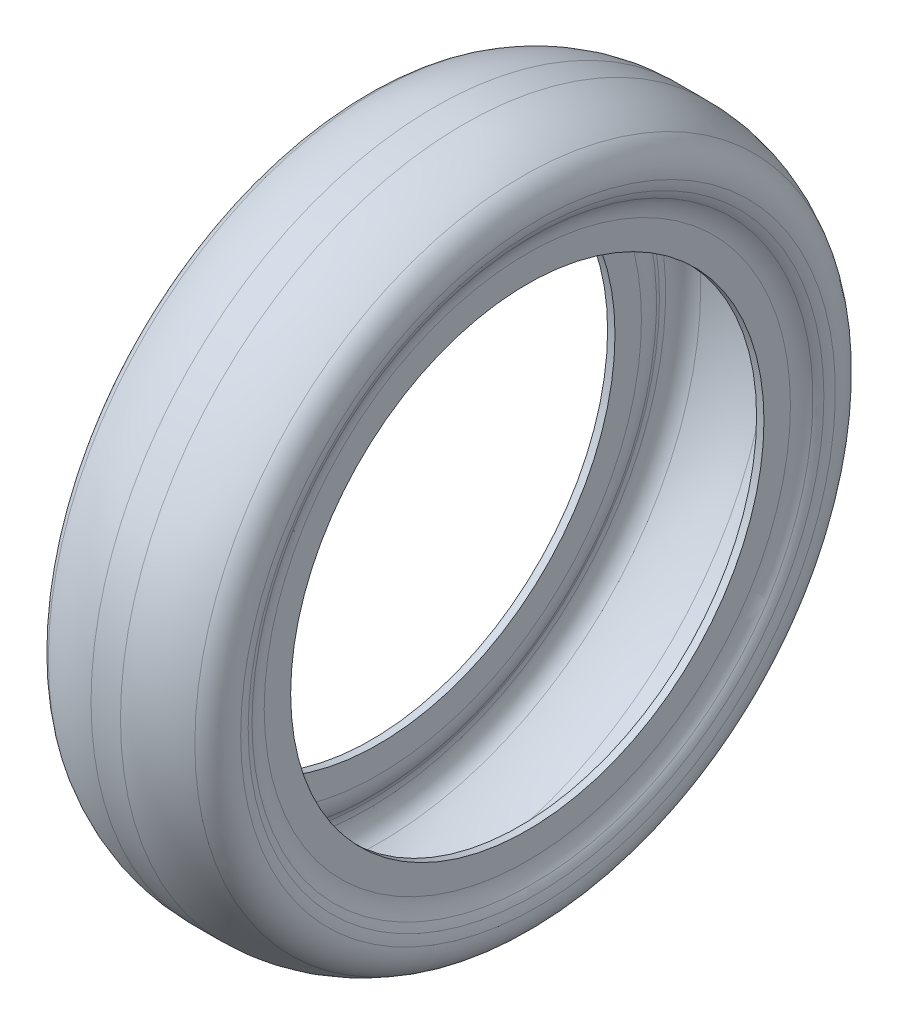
ISO-10303-21;
HEADER;
FILE_DESCRIPTION(('STEP AP214'),'2;1');
FILE_NAME('part.step','',(''),(''),'','','');
FILE_SCHEMA(('AUTOMOTIVE_DESIGN { 1 0 10303 214 1 1 1 1 }'));
ENDSEC;
DATA;
#1=APPLICATION_CONTEXT('core data for automotive mechanical design processes');
#2=APPLICATION_PROTOCOL_DEFINITION('international standard','automotive_design',2000,#1);
#3=PRODUCT_CONTEXT('',#1,'mechanical');
#4=PRODUCT('Part','Part','',(#3));
#5=PRODUCT_RELATED_PRODUCT_CATEGORY('part','',(#4));
#6=PRODUCT_DEFINITION_FORMATION('','',#4);
#7=PRODUCT_DEFINITION_CONTEXT('part definition',#1,'design');
#8=PRODUCT_DEFINITION('design','',#6,#7);
#9=PRODUCT_DEFINITION_SHAPE('','',#8);
#10=(LENGTH_UNIT() NAMED_UNIT(*) SI_UNIT(.MILLI.,.METRE.));
#11=(NAMED_UNIT(*) PLANE_ANGLE_UNIT() SI_UNIT($,.RADIAN.));
#12=(NAMED_UNIT(*) SI_UNIT($,.STERADIAN.) SOLID_ANGLE_UNIT());
#13=UNCERTAINTY_MEASURE_WITH_UNIT(LENGTH_MEASURE(1.E-05),#10,'distance_accuracy_value','');
#14=(GEOMETRIC_REPRESENTATION_CONTEXT(3) GLOBAL_UNCERTAINTY_ASSIGNED_CONTEXT((#13)) GLOBAL_UNIT_ASSIGNED_CONTEXT((#10,
#11,#12)) REPRESENTATION_CONTEXT('',''));
#15=CARTESIAN_POINT('',(0.,0.,0.));
#16=DIRECTION('',(0.,0.,1.));
#17=DIRECTION('',(1.,0.,0.));
#18=AXIS2_PLACEMENT_3D('',#15,#16,#17);
#19=CARTESIAN_POINT('',(-74.,224.,0.));
#20=DIRECTION('',(1.,0.,0.));
#21=DIRECTION('',(0.,0.,-1.));
#22=AXIS2_PLACEMENT_3D('',#19,#20,#21);
#23=PLANE('',#22);
#24=CARTESIAN_POINT('',(-74.,0.,0.));
#25=DIRECTION('',(-1.,0.,0.));
#26=DIRECTION('',(0.,0.,1.));
#27=AXIS2_PLACEMENT_3D('',#24,#25,#26);
#28=CIRCLE('',#27,224.);
#29=CARTESIAN_POINT('',(-74.,0.,224.));
#30=VERTEX_POINT('',#29);
#31=EDGE_CURVE('E10',#30,#30,#28,.T.);
#32=ORIENTED_EDGE('',*,*,#31,.F.);
#33=EDGE_LOOP('',(#32));
#34=FACE_BOUND('',#33,.T.);
#35=CARTESIAN_POINT('',(-74.,0.,0.));
#36=DIRECTION('',(-1.,0.,0.));
#37=DIRECTION('',(0.,0.,1.));
#38=AXIS2_PLACEMENT_3D('',#35,#36,#37);
#39=CIRCLE('',#38,249.04926879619);
#40=CARTESIAN_POINT('',(-74.,0.,249.04926879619));
#41=VERTEX_POINT('',#40);
#42=EDGE_CURVE('E120',#41,#41,#39,.T.);
#43=ORIENTED_EDGE('',*,*,#42,.T.);
#44=EDGE_LOOP('',(#43));
#45=FACE_BOUND('',#44,.T.);
#46=ADVANCED_FACE('F32',(#34,#45),#23,.F.);
#47=CARTESIAN_POINT('',(130.136206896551,0.,0.));
#48=DIRECTION('',(-1.,0.,0.));
#49=DIRECTION('',(0.,0.,1.));
#50=AXIS2_PLACEMENT_3D('',#47,#48,#49);
#51=CYLINDRICAL_SURFACE('',#50,224.);
#52=ORIENTED_EDGE('',*,*,#31,.T.);
#53=EDGE_LOOP('',(#52));
#54=FACE_BOUND('',#53,.T.);
#55=CARTESIAN_POINT('',(-67.,0.,0.));
#56=DIRECTION('',(-1.,0.,0.));
#57=DIRECTION('',(0.,0.,1.));
#58=AXIS2_PLACEMENT_3D('',#55,#56,#57);
#59=CIRCLE('',#58,224.);
#60=CARTESIAN_POINT('',(-67.,0.,224.));
#61=VERTEX_POINT('',#60);
#62=EDGE_CURVE('E38',#61,#61,#59,.T.);
#63=ORIENTED_EDGE('',*,*,#62,.F.);
#64=EDGE_LOOP('',(#63));
#65=FACE_BOUND('',#64,.T.);
#66=ADVANCED_FACE('F209',(#54,#65),#51,.F.);
#67=CARTESIAN_POINT('',(-67.,224.,0.));
#68=DIRECTION('',(1.,0.,0.));
#69=DIRECTION('',(0.,0.,-1.));
#70=AXIS2_PLACEMENT_3D('',#67,#68,#69);
#71=PLANE('',#70);
#72=ORIENTED_EDGE('',*,*,#62,.T.);
#73=EDGE_LOOP('',(#72));
#74=FACE_BOUND('',#73,.T.);
#75=CARTESIAN_POINT('',(-67.,0.,0.));
#76=DIRECTION('',(-1.,0.,0.));
#77=DIRECTION('',(0.,0.,1.));
#78=AXIS2_PLACEMENT_3D('',#75,#76,#77);
#79=CIRCLE('',#78,249.04926879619);
#80=CARTESIAN_POINT('',(-67.,0.,249.04926879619));
#81=VERTEX_POINT('',#80);
#82=EDGE_CURVE('E42',#81,#81,#79,.T.);
#83=ORIENTED_EDGE('',*,*,#82,.F.);
#84=EDGE_LOOP('',(#83));
#85=FACE_BOUND('',#84,.T.);
#86=ADVANCED_FACE('F214',(#74,#85),#71,.T.);
#87=CARTESIAN_POINT('',(-104.,0.,0.));
#88=DIRECTION('',(-1.,0.,0.));
#89=DIRECTION('',(0.,0.,1.));
#90=AXIS2_PLACEMENT_3D('',#87,#88,#89);
#91=TOROIDAL_SURFACE('',#90,249.04926879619,37.);
#92=ORIENTED_EDGE('',*,*,#82,.T.);
#93=EDGE_LOOP('',(#92));
#94=FACE_BOUND('',#93,.T.);
#95=CARTESIAN_POINT('',(-73.0245367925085,0.,0.));
#96=DIRECTION('',(-1.,0.,0.));
#97=DIRECTION('',(0.,0.,1.));
#98=AXIS2_PLACEMENT_3D('',#95,#96,#97);
#99=CIRCLE('',#98,269.285886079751);
#100=CARTESIAN_POINT('',(-73.0245367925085,0.,269.285886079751));
#101=VERTEX_POINT('',#100);
#102=EDGE_CURVE('E46',#101,#101,#99,.T.);
#103=ORIENTED_EDGE('',*,*,#102,.F.);
#104=EDGE_LOOP('',(#103));
#105=FACE_BOUND('',#104,.T.);
#106=ADVANCED_FACE('F218',(#94,#105),#91,.T.);
#107=CARTESIAN_POINT('',(-53.7695191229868,0.,0.));
#108=DIRECTION('',(-1.,0.,0.));
#109=DIRECTION('',(0.,0.,1.));
#110=AXIS2_PLACEMENT_3D('',#107,#108,#109);
#111=TOROIDAL_SURFACE('',#110,281.865404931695,23.);
#112=ORIENTED_EDGE('',*,*,#102,.T.);
#113=EDGE_LOOP('',(#112));
#114=FACE_BOUND('',#113,.T.);
#115=CARTESIAN_POINT('',(-75.6103551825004,0.,0.));
#116=DIRECTION('',(-1.,0.,0.));
#117=DIRECTION('',(0.,0.,1.));
#118=AXIS2_PLACEMENT_3D('',#115,#116,#117);
#119=CIRCLE('',#118,274.655836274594);
#120=CARTESIAN_POINT('',(-75.6103551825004,0.,274.655836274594));
#121=VERTEX_POINT('',#120);
#122=EDGE_CURVE('E51',#121,#121,#119,.T.);
#123=ORIENTED_EDGE('',*,*,#122,.F.);
#124=EDGE_LOOP('',(#123));
#125=FACE_BOUND('',#124,.T.);
#126=ADVANCED_FACE('F224',(#114,#125),#111,.F.);
#127=CARTESIAN_POINT('',(-44.2735034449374,0.,0.));
#128=DIRECTION('',(-1.,0.,0.));
#129=DIRECTION('',(0.,0.,1.));
#130=AXIS2_PLACEMENT_3D('',#127,#128,#129);
#131=TOROIDAL_SURFACE('',#130,285.,33.);
#132=ORIENTED_EDGE('',*,*,#122,.T.);
#133=EDGE_LOOP('',(#132));
#134=FACE_BOUND('',#133,.T.);
#135=CARTESIAN_POINT('',(-77.1417079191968,0.,0.));
#136=DIRECTION('',(-1.,0.,0.));
#137=DIRECTION('',(0.,0.,1.));
#138=AXIS2_PLACEMENT_3D('',#135,#136,#137);
#139=CIRCLE('',#138,282.053623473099);
#140=CARTESIAN_POINT('',(-77.1417079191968,0.,282.053623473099));
#141=VERTEX_POINT('',#140);
#142=EDGE_CURVE('E54',#141,#141,#139,.T.);
#143=ORIENTED_EDGE('',*,*,#142,.F.);
#144=EDGE_LOOP('',(#143));
#145=FACE_BOUND('',#144,.T.);
#146=ADVANCED_FACE('F228',(#134,#145),#131,.F.);
#147=CARTESIAN_POINT('',(-54.2335654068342,0.,0.));
#148=DIRECTION('',(-1.,0.,0.));
#149=DIRECTION('',(0.,0.,1.));
#150=AXIS2_PLACEMENT_3D('',#147,#148,#149);
#151=TOROIDAL_SURFACE('',#150,284.107158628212,23.);
#152=ORIENTED_EDGE('',*,*,#142,.T.);
#153=EDGE_LOOP('',(#152));
#154=FACE_BOUND('',#153,.T.);
#155=CARTESIAN_POINT('',(-65.8202100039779,0.,0.));
#156=DIRECTION('',(-1.,0.,0.));
#157=DIRECTION('',(0.,0.,1.));
#158=AXIS2_PLACEMENT_3D('',#155,#156,#157);
#159=CIRCLE('',#158,303.975466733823);
#160=CARTESIAN_POINT('',(-65.8202100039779,0.,303.975466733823));
#161=VERTEX_POINT('',#160);
#162=EDGE_CURVE('E57',#161,#161,#159,.T.);
#163=ORIENTED_EDGE('',*,*,#162,.F.);
#164=EDGE_LOOP('',(#163));
#165=FACE_BOUND('',#164,.T.);
#166=ADVANCED_FACE('F232',(#154,#165),#151,.F.);
#167=CARTESIAN_POINT('',(-13.9321928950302,0.,0.));
#168=DIRECTION('',(-1.,0.,0.));
#169=DIRECTION('',(0.,0.,1.));
#170=AXIS2_PLACEMENT_3D('',#167,#168,#169);
#171=TOROIDAL_SURFACE('',#170,215.,103.);
#172=ORIENTED_EDGE('',*,*,#162,.T.);
#173=EDGE_LOOP('',(#172));
#174=FACE_BOUND('',#173,.T.);
#175=CARTESIAN_POINT('',(-13.9321928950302,0.,0.));
#176=DIRECTION('',(-1.,0.,0.));
#177=DIRECTION('',(0.,0.,1.));
#178=AXIS2_PLACEMENT_3D('',#175,#176,#177);
#179=CIRCLE('',#178,318.);
#180=CARTESIAN_POINT('',(-13.9321928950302,0.,318.));
#181=VERTEX_POINT('',#180);
#182=EDGE_CURVE('E60',#181,#181,#179,.T.);
#183=ORIENTED_EDGE('',*,*,#182,.F.);
#184=EDGE_LOOP('',(#183));
#185=FACE_BOUND('',#184,.T.);
#186=ADVANCED_FACE('F236',(#174,#185),#171,.F.);
#187=CARTESIAN_POINT('',(130.136206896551,0.,0.));
#188=DIRECTION('',(-1.,0.,0.));
#189=DIRECTION('',(0.,0.,1.));
#190=AXIS2_PLACEMENT_3D('',#187,#188,#189);
#191=CYLINDRICAL_SURFACE('',#190,318.);
#192=ORIENTED_EDGE('',*,*,#182,.T.);
#193=EDGE_LOOP('',(#192));
#194=FACE_BOUND('',#193,.T.);
#195=CARTESIAN_POINT('',(13.9321928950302,0.,0.));
#196=DIRECTION('',(-1.,0.,0.));
#197=DIRECTION('',(0.,0.,1.));
#198=AXIS2_PLACEMENT_3D('',#195,#196,#197);
#199=CIRCLE('',#198,318.);
#200=CARTESIAN_POINT('',(13.9321928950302,0.,318.));
#201=VERTEX_POINT('',#200);
#202=EDGE_CURVE('E63',#201,#201,#199,.T.);
#203=ORIENTED_EDGE('',*,*,#202,.F.);
#204=EDGE_LOOP('',(#203));
#205=FACE_BOUND('',#204,.T.);
#206=ADVANCED_FACE('F240',(#194,#205),#191,.F.);
#207=CARTESIAN_POINT('',(13.9321928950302,0.,0.));
#208=DIRECTION('',(-1.,0.,0.));
#209=DIRECTION('',(0.,0.,1.));
#210=AXIS2_PLACEMENT_3D('',#207,#208,#209);
#211=TOROIDAL_SURFACE('',#210,215.,103.);
#212=ORIENTED_EDGE('',*,*,#202,.T.);
#213=EDGE_LOOP('',(#212));
#214=FACE_BOUND('',#213,.T.);
#215=CARTESIAN_POINT('',(65.8202100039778,0.,0.));
#216=DIRECTION('',(-1.,0.,0.));
#217=DIRECTION('',(0.,0.,1.));
#218=AXIS2_PLACEMENT_3D('',#215,#216,#217);
#219=CIRCLE('',#218,303.975466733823);
#220=CARTESIAN_POINT('',(65.8202100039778,0.,303.975466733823));
#221=VERTEX_POINT('',#220);
#222=EDGE_CURVE('E66',#221,#221,#219,.T.);
#223=ORIENTED_EDGE('',*,*,#222,.F.);
#224=EDGE_LOOP('',(#223));
#225=FACE_BOUND('',#224,.T.);
#226=ADVANCED_FACE('F244',(#214,#225),#211,.F.);
#227=CARTESIAN_POINT('',(54.2335654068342,0.,0.));
#228=DIRECTION('',(-1.,0.,0.));
#229=DIRECTION('',(0.,0.,1.));
#230=AXIS2_PLACEMENT_3D('',#227,#228,#229);
#231=TOROIDAL_SURFACE('',#230,284.107158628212,23.);
#232=ORIENTED_EDGE('',*,*,#222,.T.);
#233=EDGE_LOOP('',(#232));
#234=FACE_BOUND('',#233,.T.);
#235=CARTESIAN_POINT('',(77.1417079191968,0.,0.));
#236=DIRECTION('',(-1.,0.,0.));
#237=DIRECTION('',(0.,0.,1.));
#238=AXIS2_PLACEMENT_3D('',#235,#236,#237);
#239=CIRCLE('',#238,282.053623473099);
#240=CARTESIAN_POINT('',(77.1417079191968,0.,282.053623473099));
#241=VERTEX_POINT('',#240);
#242=EDGE_CURVE('E69',#241,#241,#239,.T.);
#243=ORIENTED_EDGE('',*,*,#242,.F.);
#244=EDGE_LOOP('',(#243));
#245=FACE_BOUND('',#244,.T.);
#246=ADVANCED_FACE('F248',(#234,#245),#231,.F.);
#247=CARTESIAN_POINT('',(44.2735034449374,0.,0.));
#248=DIRECTION('',(-1.,0.,0.));
#249=DIRECTION('',(0.,0.,1.));
#250=AXIS2_PLACEMENT_3D('',#247,#248,#249);
#251=TOROIDAL_SURFACE('',#250,285.,33.);
#252=ORIENTED_EDGE('',*,*,#242,.T.);
#253=EDGE_LOOP('',(#252));
#254=FACE_BOUND('',#253,.T.);
#255=CARTESIAN_POINT('',(75.6103551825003,0.,0.));
#256=DIRECTION('',(-1.,0.,0.));
#257=DIRECTION('',(0.,0.,1.));
#258=AXIS2_PLACEMENT_3D('',#255,#256,#257);
#259=CIRCLE('',#258,274.655836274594);
#260=CARTESIAN_POINT('',(75.6103551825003,0.,274.655836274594));
#261=VERTEX_POINT('',#260);
#262=EDGE_CURVE('E72',#261,#261,#259,.T.);
#263=ORIENTED_EDGE('',*,*,#262,.F.);
#264=EDGE_LOOP('',(#263));
#265=FACE_BOUND('',#264,.T.);
#266=ADVANCED_FACE('F252',(#254,#265),#251,.F.);
#267=CARTESIAN_POINT('',(53.7695191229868,0.,0.));
#268=DIRECTION('',(-1.,0.,0.));
#269=DIRECTION('',(0.,0.,1.));
#270=AXIS2_PLACEMENT_3D('',#267,#268,#269);
#271=TOROIDAL_SURFACE('',#270,281.865404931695,23.);
#272=ORIENTED_EDGE('',*,*,#262,.T.);
#273=EDGE_LOOP('',(#272));
#274=FACE_BOUND('',#273,.T.);
#275=CARTESIAN_POINT('',(73.0245367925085,0.,0.));
#276=DIRECTION('',(-1.,0.,0.));
#277=DIRECTION('',(0.,0.,1.));
#278=AXIS2_PLACEMENT_3D('',#275,#276,#277);
#279=CIRCLE('',#278,269.285886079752);
#280=CARTESIAN_POINT('',(73.0245367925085,0.,269.285886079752));
#281=VERTEX_POINT('',#280);
#282=EDGE_CURVE('E75',#281,#281,#279,.T.);
#283=ORIENTED_EDGE('',*,*,#282,.F.);
#284=EDGE_LOOP('',(#283));
#285=FACE_BOUND('',#284,.T.);
#286=ADVANCED_FACE('F256',(#274,#285),#271,.F.);
#287=CARTESIAN_POINT('',(104.,0.,0.));
#288=DIRECTION('',(-1.,0.,0.));
#289=DIRECTION('',(0.,0.,1.));
#290=AXIS2_PLACEMENT_3D('',#287,#288,#289);
#291=TOROIDAL_SURFACE('',#290,249.04926879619,37.);
#292=ORIENTED_EDGE('',*,*,#282,.T.);
#293=EDGE_LOOP('',(#292));
#294=FACE_BOUND('',#293,.T.);
#295=CARTESIAN_POINT('',(67.,0.,0.));
#296=DIRECTION('',(-1.,0.,0.));
#297=DIRECTION('',(0.,0.,1.));
#298=AXIS2_PLACEMENT_3D('',#295,#296,#297);
#299=CIRCLE('',#298,249.04926879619);
#300=CARTESIAN_POINT('',(67.,0.,249.04926879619));
#301=VERTEX_POINT('',#300);
#302=EDGE_CURVE('E78',#301,#301,#299,.T.);
#303=ORIENTED_EDGE('',*,*,#302,.F.);
#304=EDGE_LOOP('',(#303));
#305=FACE_BOUND('',#304,.T.);
#306=ADVANCED_FACE('F205',(#294,#305),#291,.T.);
#307=CARTESIAN_POINT('',(67.,224.,0.));
#308=DIRECTION('',(-1.,0.,0.));
#309=DIRECTION('',(0.,0.,1.));
#310=AXIS2_PLACEMENT_3D('',#307,#308,#309);
#311=PLANE('',#310);
#312=ORIENTED_EDGE('',*,*,#302,.T.);
#313=EDGE_LOOP('',(#312));
#314=FACE_BOUND('',#313,.T.);
#315=CARTESIAN_POINT('',(67.,0.,0.));
#316=DIRECTION('',(-1.,0.,0.));
#317=DIRECTION('',(0.,0.,1.));
#318=AXIS2_PLACEMENT_3D('',#315,#316,#317);
#319=CIRCLE('',#318,224.);
#320=CARTESIAN_POINT('',(67.,0.,224.));
#321=VERTEX_POINT('',#320);
#322=EDGE_CURVE('E81',#321,#321,#319,.T.);
#323=ORIENTED_EDGE('',*,*,#322,.F.);
#324=EDGE_LOOP('',(#323));
#325=FACE_BOUND('',#324,.T.);
#326=ADVANCED_FACE('F199',(#314,#325),#311,.T.);
#327=CARTESIAN_POINT('',(130.136206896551,0.,0.));
#328=DIRECTION('',(-1.,0.,0.));
#329=DIRECTION('',(0.,0.,1.));
#330=AXIS2_PLACEMENT_3D('',#327,#328,#329);
#331=CYLINDRICAL_SURFACE('',#330,224.);
#332=ORIENTED_EDGE('',*,*,#322,.T.);
#333=EDGE_LOOP('',(#332));
#334=FACE_BOUND('',#333,.T.);
#335=CARTESIAN_POINT('',(74.,0.,0.));
#336=DIRECTION('',(-1.,0.,0.));
#337=DIRECTION('',(0.,0.,1.));
#338=AXIS2_PLACEMENT_3D('',#335,#336,#337);
#339=CIRCLE('',#338,224.);
#340=CARTESIAN_POINT('',(74.,0.,224.));
#341=VERTEX_POINT('',#340);
#342=EDGE_CURVE('E84',#341,#341,#339,.T.);
#343=ORIENTED_EDGE('',*,*,#342,.F.);
#344=EDGE_LOOP('',(#343));
#345=FACE_BOUND('',#344,.T.);
#346=ADVANCED_FACE('F194',(#334,#345),#331,.F.);
#347=CARTESIAN_POINT('',(74.,224.,0.));
#348=DIRECTION('',(-1.,0.,0.));
#349=DIRECTION('',(0.,0.,1.));
#350=AXIS2_PLACEMENT_3D('',#347,#348,#349);
#351=PLANE('',#350);
#352=CARTESIAN_POINT('',(74.,0.,0.));
#353=DIRECTION('',(-1.,0.,0.));
#354=DIRECTION('',(0.,0.,1.));
#355=AXIS2_PLACEMENT_3D('',#352,#353,#354);
#356=CIRCLE('',#355,249.04926879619);
#357=CARTESIAN_POINT('',(74.,0.,249.04926879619));
#358=VERTEX_POINT('',#357);
#359=EDGE_CURVE('E87',#358,#358,#356,.T.);
#360=ORIENTED_EDGE('',*,*,#359,.F.);
#361=EDGE_LOOP('',(#360));
#362=FACE_BOUND('',#361,.T.);
#363=ORIENTED_EDGE('',*,*,#342,.T.);
#364=EDGE_LOOP('',(#363));
#365=FACE_BOUND('',#364,.T.);
#366=ADVANCED_FACE('F188',(#362,#365),#351,.F.);
#367=CARTESIAN_POINT('',(104.,0.,0.));
#368=DIRECTION('',(-1.,0.,0.));
#369=DIRECTION('',(0.,0.,1.));
#370=AXIS2_PLACEMENT_3D('',#367,#368,#369);
#371=TOROIDAL_SURFACE('',#370,249.04926879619,30.);
#372=CARTESIAN_POINT('',(78.8847595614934,0.,0.));
#373=DIRECTION('',(-1.,0.,0.));
#374=DIRECTION('',(0.,0.,1.));
#375=AXIS2_PLACEMENT_3D('',#372,#373,#374);
#376=CIRCLE('',#375,265.457336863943);
#377=CARTESIAN_POINT('',(78.8847595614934,0.,265.457336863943));
#378=VERTEX_POINT('',#377);
#379=EDGE_CURVE('E90',#378,#378,#376,.T.);
#380=ORIENTED_EDGE('',*,*,#379,.F.);
#381=EDGE_LOOP('',(#380));
#382=FACE_BOUND('',#381,.T.);
#383=ORIENTED_EDGE('',*,*,#359,.T.);
#384=EDGE_LOOP('',(#383));
#385=FACE_BOUND('',#384,.T.);
#386=ADVANCED_FACE('F182',(#382,#385),#371,.F.);
#387=CARTESIAN_POINT('',(53.7695191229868,0.,0.));
#388=DIRECTION('',(-1.,0.,0.));
#389=DIRECTION('',(0.,0.,1.));
#390=AXIS2_PLACEMENT_3D('',#387,#388,#389);
#391=TOROIDAL_SURFACE('',#390,281.865404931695,30.);
#392=CARTESIAN_POINT('',(82.2575661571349,0.,0.));
#393=DIRECTION('',(-1.,0.,0.));
#394=DIRECTION('',(0.,0.,1.));
#395=AXIS2_PLACEMENT_3D('',#392,#393,#394);
#396=CIRCLE('',#395,272.461619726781);
#397=CARTESIAN_POINT('',(82.2575661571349,0.,272.461619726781));
#398=VERTEX_POINT('',#397);
#399=EDGE_CURVE('E93',#398,#398,#396,.T.);
#400=ORIENTED_EDGE('',*,*,#399,.F.);
#401=EDGE_LOOP('',(#400));
#402=FACE_BOUND('',#401,.T.);
#403=ORIENTED_EDGE('',*,*,#379,.T.);
#404=EDGE_LOOP('',(#403));
#405=FACE_BOUND('',#404,.T.);
#406=ADVANCED_FACE('F176',(#402,#405),#391,.T.);
#407=CARTESIAN_POINT('',(44.2735034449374,0.,0.));
#408=DIRECTION('',(-1.,0.,0.));
#409=DIRECTION('',(0.,0.,1.));
#410=AXIS2_PLACEMENT_3D('',#407,#408,#409);
#411=TOROIDAL_SURFACE('',#410,285.,40.);
#412=CARTESIAN_POINT('',(84.1137512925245,0.,0.));
#413=DIRECTION('',(-1.,0.,0.));
#414=DIRECTION('',(0.,0.,1.));
#415=AXIS2_PLACEMENT_3D('',#412,#413,#414);
#416=CIRCLE('',#415,281.428634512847);
#417=CARTESIAN_POINT('',(84.1137512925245,0.,281.428634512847));
#418=VERTEX_POINT('',#417);
#419=EDGE_CURVE('E96',#418,#418,#416,.T.);
#420=ORIENTED_EDGE('',*,*,#419,.F.);
#421=EDGE_LOOP('',(#420));
#422=FACE_BOUND('',#421,.T.);
#423=ORIENTED_EDGE('',*,*,#399,.T.);
#424=EDGE_LOOP('',(#423));
#425=FACE_BOUND('',#424,.T.);
#426=ADVANCED_FACE('F170',(#422,#425),#411,.T.);
#427=CARTESIAN_POINT('',(54.2335654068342,0.,0.));
#428=DIRECTION('',(-1.,0.,0.));
#429=DIRECTION('',(0.,0.,1.));
#430=AXIS2_PLACEMENT_3D('',#427,#428,#429);
#431=TOROIDAL_SURFACE('',#430,284.107158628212,30.);
#432=CARTESIAN_POINT('',(69.3465800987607,0.,0.));
#433=DIRECTION('',(-1.,0.,0.));
#434=DIRECTION('',(0.,0.,1.));
#435=AXIS2_PLACEMENT_3D('',#432,#433,#434);
#436=CIRCLE('',#435,310.022343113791);
#437=CARTESIAN_POINT('',(69.3465800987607,0.,310.022343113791));
#438=VERTEX_POINT('',#437);
#439=EDGE_CURVE('E99',#438,#438,#436,.T.);
#440=ORIENTED_EDGE('',*,*,#439,.F.);
#441=EDGE_LOOP('',(#440));
#442=FACE_BOUND('',#441,.T.);
#443=ORIENTED_EDGE('',*,*,#419,.T.);
#444=EDGE_LOOP('',(#443));
#445=FACE_BOUND('',#444,.T.);
#446=ADVANCED_FACE('F164',(#442,#445),#431,.T.);
#447=CARTESIAN_POINT('',(13.9321928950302,0.,0.));
#448=DIRECTION('',(-1.,0.,0.));
#449=DIRECTION('',(0.,0.,1.));
#450=AXIS2_PLACEMENT_3D('',#447,#448,#449);
#451=TOROIDAL_SURFACE('',#450,215.,110.);
#452=CARTESIAN_POINT('',(13.9321928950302,0.,0.));
#453=DIRECTION('',(-1.,0.,0.));
#454=DIRECTION('',(0.,0.,1.));
#455=AXIS2_PLACEMENT_3D('',#452,#453,#454);
#456=CIRCLE('',#455,325.);
#457=CARTESIAN_POINT('',(13.9321928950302,0.,325.));
#458=VERTEX_POINT('',#457);
#459=EDGE_CURVE('E102',#458,#458,#456,.T.);
#460=ORIENTED_EDGE('',*,*,#459,.F.);
#461=EDGE_LOOP('',(#460));
#462=FACE_BOUND('',#461,.T.);
#463=ORIENTED_EDGE('',*,*,#439,.T.);
#464=EDGE_LOOP('',(#463));
#465=FACE_BOUND('',#464,.T.);
#466=ADVANCED_FACE('F158',(#462,#465),#451,.T.);
#467=CARTESIAN_POINT('',(130.136206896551,0.,0.));
#468=DIRECTION('',(-1.,0.,0.));
#469=DIRECTION('',(0.,0.,1.));
#470=AXIS2_PLACEMENT_3D('',#467,#468,#469);
#471=CYLINDRICAL_SURFACE('',#470,325.);
#472=CARTESIAN_POINT('',(-13.9321928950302,0.,0.));
#473=DIRECTION('',(-1.,0.,0.));
#474=DIRECTION('',(0.,0.,1.));
#475=AXIS2_PLACEMENT_3D('',#472,#473,#474);
#476=CIRCLE('',#475,325.);
#477=CARTESIAN_POINT('',(-13.9321928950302,0.,325.));
#478=VERTEX_POINT('',#477);
#479=EDGE_CURVE('E105',#478,#478,#476,.T.);
#480=ORIENTED_EDGE('',*,*,#479,.F.);
#481=EDGE_LOOP('',(#480));
#482=FACE_BOUND('',#481,.T.);
#483=ORIENTED_EDGE('',*,*,#459,.T.);
#484=EDGE_LOOP('',(#483));
#485=FACE_BOUND('',#484,.T.);
#486=ADVANCED_FACE('F152',(#482,#485),#471,.T.);
#487=CARTESIAN_POINT('',(-13.9321928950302,0.,0.));
#488=DIRECTION('',(-1.,0.,0.));
#489=DIRECTION('',(0.,0.,1.));
#490=AXIS2_PLACEMENT_3D('',#487,#488,#489);
#491=TOROIDAL_SURFACE('',#490,215.,110.);
#492=CARTESIAN_POINT('',(-69.3465800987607,0.,0.));
#493=DIRECTION('',(-1.,0.,0.));
#494=DIRECTION('',(0.,0.,1.));
#495=AXIS2_PLACEMENT_3D('',#492,#493,#494);
#496=CIRCLE('',#495,310.022343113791);
#497=CARTESIAN_POINT('',(-69.3465800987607,0.,310.022343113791));
#498=VERTEX_POINT('',#497);
#499=EDGE_CURVE('E108',#498,#498,#496,.T.);
#500=ORIENTED_EDGE('',*,*,#499,.F.);
#501=EDGE_LOOP('',(#500));
#502=FACE_BOUND('',#501,.T.);
#503=ORIENTED_EDGE('',*,*,#479,.T.);
#504=EDGE_LOOP('',(#503));
#505=FACE_BOUND('',#504,.T.);
#506=ADVANCED_FACE('F146',(#502,#505),#491,.T.);
#507=CARTESIAN_POINT('',(-54.2335654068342,0.,0.));
#508=DIRECTION('',(-1.,0.,0.));
#509=DIRECTION('',(0.,0.,1.));
#510=AXIS2_PLACEMENT_3D('',#507,#508,#509);
#511=TOROIDAL_SURFACE('',#510,284.107158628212,30.);
#512=CARTESIAN_POINT('',(-84.1137512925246,0.,0.));
#513=DIRECTION('',(-1.,0.,0.));
#514=DIRECTION('',(0.,0.,1.));
#515=AXIS2_PLACEMENT_3D('',#512,#513,#514);
#516=CIRCLE('',#515,281.428634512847);
#517=CARTESIAN_POINT('',(-84.1137512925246,0.,281.428634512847));
#518=VERTEX_POINT('',#517);
#519=EDGE_CURVE('E111',#518,#518,#516,.T.);
#520=ORIENTED_EDGE('',*,*,#519,.F.);
#521=EDGE_LOOP('',(#520));
#522=FACE_BOUND('',#521,.T.);
#523=ORIENTED_EDGE('',*,*,#499,.T.);
#524=EDGE_LOOP('',(#523));
#525=FACE_BOUND('',#524,.T.);
#526=ADVANCED_FACE('F140',(#522,#525),#511,.T.);
#527=CARTESIAN_POINT('',(-44.2735034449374,0.,0.));
#528=DIRECTION('',(-1.,0.,0.));
#529=DIRECTION('',(0.,0.,1.));
#530=AXIS2_PLACEMENT_3D('',#527,#528,#529);
#531=TOROIDAL_SURFACE('',#530,285.,40.);
#532=CARTESIAN_POINT('',(-82.2575661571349,0.,0.));
#533=DIRECTION('',(-1.,0.,0.));
#534=DIRECTION('',(0.,0.,1.));
#535=AXIS2_PLACEMENT_3D('',#532,#533,#534);
#536=CIRCLE('',#535,272.461619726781);
#537=CARTESIAN_POINT('',(-82.2575661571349,0.,272.461619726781));
#538=VERTEX_POINT('',#537);
#539=EDGE_CURVE('E114',#538,#538,#536,.T.);
#540=ORIENTED_EDGE('',*,*,#539,.F.);
#541=EDGE_LOOP('',(#540));
#542=FACE_BOUND('',#541,.T.);
#543=ORIENTED_EDGE('',*,*,#519,.T.);
#544=EDGE_LOOP('',(#543));
#545=FACE_BOUND('',#544,.T.);
#546=ADVANCED_FACE('F134',(#542,#545),#531,.T.);
#547=CARTESIAN_POINT('',(-53.7695191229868,0.,0.));
#548=DIRECTION('',(-1.,0.,0.));
#549=DIRECTION('',(0.,0.,1.));
#550=AXIS2_PLACEMENT_3D('',#547,#548,#549);
#551=TOROIDAL_SURFACE('',#550,281.865404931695,30.);
#552=CARTESIAN_POINT('',(-78.8847595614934,0.,0.));
#553=DIRECTION('',(-1.,0.,0.));
#554=DIRECTION('',(0.,0.,1.));
#555=AXIS2_PLACEMENT_3D('',#552,#553,#554);
#556=CIRCLE('',#555,265.457336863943);
#557=CARTESIAN_POINT('',(-78.8847595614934,0.,265.457336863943));
#558=VERTEX_POINT('',#557);
#559=EDGE_CURVE('E117',#558,#558,#556,.T.);
#560=ORIENTED_EDGE('',*,*,#559,.F.);
#561=EDGE_LOOP('',(#560));
#562=FACE_BOUND('',#561,.T.);
#563=ORIENTED_EDGE('',*,*,#539,.T.);
#564=EDGE_LOOP('',(#563));
#565=FACE_BOUND('',#564,.T.);
#566=ADVANCED_FACE('F128',(#562,#565),#551,.T.);
#567=CARTESIAN_POINT('',(-104.,0.,0.));
#568=DIRECTION('',(-1.,0.,0.));
#569=DIRECTION('',(0.,0.,1.));
#570=AXIS2_PLACEMENT_3D('',#567,#568,#569);
#571=TOROIDAL_SURFACE('',#570,249.04926879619,30.);
#572=ORIENTED_EDGE('',*,*,#42,.F.);
#573=EDGE_LOOP('',(#572));
#574=FACE_BOUND('',#573,.T.);
#575=ORIENTED_EDGE('',*,*,#559,.T.);
#576=EDGE_LOOP('',(#575));
#577=FACE_BOUND('',#576,.T.);
#578=ADVANCED_FACE('F125',(#574,#577),#571,.F.);
#579=CLOSED_SHELL('',(#46,#66,#86,#106,#126,#146,#166,#186,#206,#226,#246,#266,#286,#306,#326,
#346,#366,#386,#406,#426,#446,#466,#486,#506,#526,#546,#566,#578));
#580=MANIFOLD_SOLID_BREP('B2',#579);
#581=ADVANCED_BREP_SHAPE_REPRESENTATION('',(#18,#580),#14);
#582=SHAPE_DEFINITION_REPRESENTATION(#9,#581);
ENDSEC;
END-ISO-10303-21;
